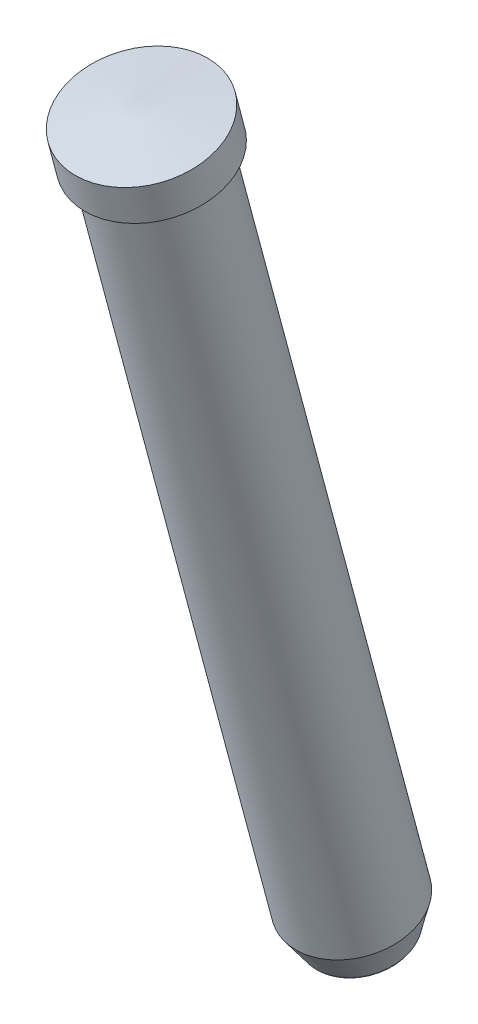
ISO-10303-21;
HEADER;
FILE_DESCRIPTION(('STEP AP214'),'2;1');
FILE_NAME('part.step','',(''),(''),'','','');
FILE_SCHEMA(('AUTOMOTIVE_DESIGN { 1 0 10303 214 1 1 1 1 }'));
ENDSEC;
DATA;
#1=APPLICATION_CONTEXT('core data for automotive mechanical design processes');
#2=APPLICATION_PROTOCOL_DEFINITION('international standard','automotive_design',2000,#1);
#3=PRODUCT_CONTEXT('',#1,'mechanical');
#4=PRODUCT('Part','Part','',(#3));
#5=PRODUCT_RELATED_PRODUCT_CATEGORY('part','',(#4));
#6=PRODUCT_DEFINITION_FORMATION('','',#4);
#7=PRODUCT_DEFINITION_CONTEXT('part definition',#1,'design');
#8=PRODUCT_DEFINITION('design','',#6,#7);
#9=PRODUCT_DEFINITION_SHAPE('','',#8);
#10=(LENGTH_UNIT() NAMED_UNIT(*) SI_UNIT(.MILLI.,.METRE.));
#11=(NAMED_UNIT(*) PLANE_ANGLE_UNIT() SI_UNIT($,.RADIAN.));
#12=(NAMED_UNIT(*) SI_UNIT($,.STERADIAN.) SOLID_ANGLE_UNIT());
#13=UNCERTAINTY_MEASURE_WITH_UNIT(LENGTH_MEASURE(1.E-05),#10,'distance_accuracy_value','');
#14=(GEOMETRIC_REPRESENTATION_CONTEXT(3) GLOBAL_UNCERTAINTY_ASSIGNED_CONTEXT((#13)) GLOBAL_UNIT_ASSIGNED_CONTEXT((#10,
#11,#12)) REPRESENTATION_CONTEXT('',''));
#15=CARTESIAN_POINT('',(0.,0.,0.));
#16=DIRECTION('',(0.,0.,1.));
#17=DIRECTION('',(1.,0.,0.));
#18=AXIS2_PLACEMENT_3D('',#15,#16,#17);
#19=CARTESIAN_POINT('',(-5.369024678,-51.300704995,-51.872205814));
#20=DIRECTION('',(0.,-0.96592582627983,-0.258819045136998));
#21=DIRECTION('',(0.,0.258819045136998,-0.96592582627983));
#22=AXIS2_PLACEMENT_3D('',#19,#20,#21);
#23=PLANE('',#22);
#24=CARTESIAN_POINT('',(0.,-51.284227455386,-51.9337008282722));
#25=CARTESIAN_POINT('',(10.6107207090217,-51.284227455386,-51.9337008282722));
#26=CARTESIAN_POINT('',(10.6107207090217,-48.5379708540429,-62.1828699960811));
#27=CARTESIAN_POINT('',(0.,-48.5379708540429,-62.1828699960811));
#28=(BOUNDED_CURVE() B_SPLINE_CURVE(3,(#24,#25,#26,#27),.UNSPECIFIED.,.F.,
.F.) B_SPLINE_CURVE_WITH_KNOTS((4,4),(0.,1.),
.UNSPECIFIED.) CURVE() GEOMETRIC_REPRESENTATION_ITEM() RATIONAL_B_SPLINE_CURVE((0.967213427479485,
0.322404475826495,0.322404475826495,0.967213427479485)) REPRESENTATION_ITEM(''));
#29=CARTESIAN_POINT('',(0.,-51.2842274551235,-51.9337008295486));
#30=VERTEX_POINT('',#29);
#31=CARTESIAN_POINT('',(0.,-48.5379708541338,-62.1828699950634));
#32=VERTEX_POINT('',#31);
#33=EDGE_CURVE('E66',#30,#32,#28,.T.);
#34=ORIENTED_EDGE('',*,*,#33,.F.);
#35=CARTESIAN_POINT('',(0.,-48.5379708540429,-62.1828699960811));
#36=CARTESIAN_POINT('',(-10.6107207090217,-48.5379708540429,-62.1828699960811));
#37=CARTESIAN_POINT('',(-10.6107207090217,-51.284227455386,-51.9337008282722));
#38=CARTESIAN_POINT('',(0.,-51.284227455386,-51.9337008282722));
#39=(BOUNDED_CURVE() B_SPLINE_CURVE(3,(#35,#36,#37,#38),.UNSPECIFIED.,.F.,
.F.) B_SPLINE_CURVE_WITH_KNOTS((4,4),(0.,1.),
.UNSPECIFIED.) CURVE() GEOMETRIC_REPRESENTATION_ITEM() RATIONAL_B_SPLINE_CURVE((0.967213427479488,
0.322404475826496,0.322404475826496,0.967213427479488)) REPRESENTATION_ITEM(''));
#40=EDGE_CURVE('E63',#32,#30,#39,.T.);
#41=ORIENTED_EDGE('',*,*,#40,.F.);
#42=EDGE_LOOP('',(#34,#41));
#43=FACE_BOUND('',#42,.T.);
#44=ADVANCED_FACE('F24',(#43),#23,.T.);
#45=CARTESIAN_POINT('',(0.,-50.837379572,-50.820154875));
#46=CARTESIAN_POINT('',(12.530620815,-50.837379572,-50.820154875));
#47=CARTESIAN_POINT('',(12.530620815,-47.594216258,-62.923805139));
#48=CARTESIAN_POINT('',(0.,-47.594216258,-62.923805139));
#49=CARTESIAN_POINT('',(0.,-51.267861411,-51.081587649));
#50=CARTESIAN_POINT('',(12.248405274,-51.267861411,-51.081587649));
#51=CARTESIAN_POINT('',(12.248405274,-48.097740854,-62.912638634));
#52=CARTESIAN_POINT('',(0.,-48.097740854,-62.912638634));
#53=CARTESIAN_POINT('',(0.,-51.43183329,-51.557796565));
#54=CARTESIAN_POINT('',(11.413318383,-51.43183329,-51.557796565));
#55=CARTESIAN_POINT('',(11.413318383,-48.477849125,-62.582215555));
#56=CARTESIAN_POINT('',(0.,-48.477849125,-62.582215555));
#57=CARTESIAN_POINT('',(0.,-51.25356306,-52.028839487));
#58=CARTESIAN_POINT('',(10.411053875,-51.25356306,-52.028839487));
#59=CARTESIAN_POINT('',(10.411053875,-48.558984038,-62.085145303));
#60=CARTESIAN_POINT('',(0.,-48.558984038,-62.085145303));
#61=(BOUNDED_SURFACE() B_SPLINE_SURFACE(3,3,((#45,#46,#47,#48),(#49,#50,#51,#52),(#53,#54,#55,
#56),(#57,#58,#59,#60)),.UNSPECIFIED.,.F.,.F.,.F.) B_SPLINE_SURFACE_WITH_KNOTS((4,4),(4,4),(0.,
1.),(0.,1.),.UNSPECIFIED.) GEOMETRIC_REPRESENTATION_ITEM() RATIONAL_B_SPLINE_SURFACE(((1.,
0.333333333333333,0.333333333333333,1.),(0.846046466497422,0.282015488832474,0.282015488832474,
0.846046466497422),(0.846046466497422,0.282015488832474,0.282015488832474,0.846046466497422),
(1.,0.333333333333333,0.333333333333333,1.))) REPRESENTATION_ITEM('') SURFACE());
#62=CARTESIAN_POINT('',(0.,-47.594216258,-62.923805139));
#63=CARTESIAN_POINT('',(0.,-48.097740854,-62.912638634));
#64=CARTESIAN_POINT('',(0.,-48.477849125,-62.582215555));
#65=CARTESIAN_POINT('',(0.,-48.558984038,-62.085145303));
#66=(BOUNDED_CURVE() B_SPLINE_CURVE(3,(#62,#63,#64,#65),.UNSPECIFIED.,.F.,
.F.) B_SPLINE_CURVE_WITH_KNOTS((4,4),(0.,1.),
.UNSPECIFIED.) CURVE() GEOMETRIC_REPRESENTATION_ITEM() RATIONAL_B_SPLINE_CURVE((1.,
0.846046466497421,0.846046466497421,1.)) REPRESENTATION_ITEM(''));
#67=CARTESIAN_POINT('',(2.79821379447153E-10,-47.6939143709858,-62.916597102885));
#68=VERTEX_POINT('',#67);
#69=EDGE_CURVE('E82',#68,#32,#66,.T.);
#70=CARTESIAN_POINT('',(0.,-49.3070155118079,-56.8964216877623));
#71=DIRECTION('',(0.,0.965925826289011,0.258819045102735));
#72=DIRECTION('',(0.,0.258819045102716,-0.965925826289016));
#73=AXIS2_PLACEMENT_3D('',#70,#71,#72);
#74=CIRCLE('',#73,6.23254420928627);
#75=CARTESIAN_POINT('',(1.91747427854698E-09,-50.9201166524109,-50.8762462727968));
#76=VERTEX_POINT('',#75);
#77=EDGE_CURVE('E78',#68,#76,#74,.F.);
#78=CARTESIAN_POINT('',(0.,-50.837379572,-50.820154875));
#79=CARTESIAN_POINT('',(0.,-51.267861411,-51.081587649));
#80=CARTESIAN_POINT('',(0.,-51.43183329,-51.557796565));
#81=CARTESIAN_POINT('',(0.,-51.25356306,-52.028839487));
#82=(BOUNDED_CURVE() B_SPLINE_CURVE(3,(#78,#79,#80,#81),.UNSPECIFIED.,.F.,
.F.) B_SPLINE_CURVE_WITH_KNOTS((4,4),(0.,1.),
.UNSPECIFIED.) CURVE() GEOMETRIC_REPRESENTATION_ITEM() RATIONAL_B_SPLINE_CURVE((1.,
0.846046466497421,0.846046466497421,1.)) REPRESENTATION_ITEM(''));
#83=EDGE_CURVE('E75',#30,#76,#82,.F.);
#84=ORIENTED_EDGE('',*,*,#69,.F.);
#85=ORIENTED_EDGE('',*,*,#77,.T.);
#86=ORIENTED_EDGE('',*,*,#83,.F.);
#87=ORIENTED_EDGE('',*,*,#33,.T.);
#88=EDGE_LOOP('',(#84,#85,#86,#87));
#89=FACE_BOUND('',#88,.T.);
#90=ADVANCED_FACE('F76',(#89),#61,.T.);
#91=CARTESIAN_POINT('',(0.,-47.594216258,-62.923805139));
#92=CARTESIAN_POINT('',(-12.530620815,-47.594216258,-62.923805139));
#93=CARTESIAN_POINT('',(-12.530620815,-50.837379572,-50.820154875));
#94=CARTESIAN_POINT('',(0.,-50.837379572,-50.820154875));
#95=CARTESIAN_POINT('',(0.,-48.097740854,-62.912638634));
#96=CARTESIAN_POINT('',(-12.248405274,-48.097740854,-62.912638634));
#97=CARTESIAN_POINT('',(-12.248405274,-51.267861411,-51.081587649));
#98=CARTESIAN_POINT('',(0.,-51.267861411,-51.081587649));
#99=CARTESIAN_POINT('',(0.,-48.477849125,-62.582215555));
#100=CARTESIAN_POINT('',(-11.413318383,-48.477849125,-62.582215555));
#101=CARTESIAN_POINT('',(-11.413318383,-51.43183329,-51.557796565));
#102=CARTESIAN_POINT('',(0.,-51.43183329,-51.557796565));
#103=CARTESIAN_POINT('',(0.,-48.558984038,-62.085145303));
#104=CARTESIAN_POINT('',(-10.411053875,-48.558984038,-62.085145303));
#105=CARTESIAN_POINT('',(-10.411053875,-51.25356306,-52.028839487));
#106=CARTESIAN_POINT('',(0.,-51.25356306,-52.028839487));
#107=(BOUNDED_SURFACE() B_SPLINE_SURFACE(3,3,((#91,#92,#93,#94),(#95,#96,#97,#98),(#99,#100,
#101,#102),(#103,#104,#105,#106)),.UNSPECIFIED.,.F.,.F.,.F.) B_SPLINE_SURFACE_WITH_KNOTS((4,4),
(4,4),(0.,1.),(0.,1.),
.UNSPECIFIED.) GEOMETRIC_REPRESENTATION_ITEM() RATIONAL_B_SPLINE_SURFACE(((1.,0.333333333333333,
0.333333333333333,1.),(0.846046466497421,0.282015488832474,0.282015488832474,0.846046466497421),
(0.846046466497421,0.282015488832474,0.282015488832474,0.846046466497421),(1.,0.333333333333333,
0.333333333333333,1.))) REPRESENTATION_ITEM('') SURFACE());
#108=CARTESIAN_POINT('',(0.,-49.3070155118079,-56.8964216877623));
#109=DIRECTION('',(0.,0.965925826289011,0.258819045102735));
#110=DIRECTION('',(0.,0.258819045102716,-0.965925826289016));
#111=AXIS2_PLACEMENT_3D('',#108,#109,#110);
#112=CIRCLE('',#111,6.23254420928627);
#113=EDGE_CURVE('E287',#76,#68,#112,.F.);
#114=ORIENTED_EDGE('',*,*,#113,.T.);
#115=ORIENTED_EDGE('',*,*,#69,.T.);
#116=ORIENTED_EDGE('',*,*,#40,.T.);
#117=ORIENTED_EDGE('',*,*,#83,.T.);
#118=EDGE_LOOP('',(#114,#115,#116,#117));
#119=FACE_BOUND('',#118,.T.);
#120=ADVANCED_FACE('F85',(#119),#107,.T.);
#121=CARTESIAN_POINT('',(0.,-49.3070155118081,-56.8964216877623));
#122=DIRECTION('',(0.,0.965925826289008,0.258819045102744));
#123=DIRECTION('',(0.,-0.258819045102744,0.965925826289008));
#124=AXIS2_PLACEMENT_3D('',#121,#122,#123);
#125=CONICAL_SURFACE('',#124,6.23254420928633,0.383972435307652);
#126=CARTESIAN_POINT('',(0.,-45.0814700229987,-55.7641901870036));
#127=DIRECTION('',(0.,-0.965925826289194,-0.258819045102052));
#128=DIRECTION('',(0.,-0.258819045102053,0.965925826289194));
#129=AXIS2_PLACEMENT_3D('',#126,#127,#128);
#130=CIRCLE('',#129,8.00000000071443);
#131=CARTESIAN_POINT('',(0.,-47.152022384,-48.036783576));
#132=VERTEX_POINT('',#131);
#133=EDGE_CURVE('E280',#132,#132,#130,.T.);
#134=ORIENTED_EDGE('',*,*,#133,.T.);
#135=EDGE_LOOP('',(#134));
#136=FACE_BOUND('',#135,.T.);
#137=ORIENTED_EDGE('',*,*,#113,.F.);
#138=ORIENTED_EDGE('',*,*,#77,.F.);
#139=EDGE_LOOP('',(#137,#138));
#140=FACE_BOUND('',#139,.T.);
#141=ADVANCED_FACE('F106',(#136,#140),#125,.T.);
#142=CARTESIAN_POINT('',(0.,57.3066675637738,-28.3293714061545));
#143=DIRECTION('',(0.,-0.965925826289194,-0.258819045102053));
#144=DIRECTION('',(0.,0.258819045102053,-0.965925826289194));
#145=AXIS2_PLACEMENT_3D('',#142,#143,#144);
#146=CYLINDRICAL_SURFACE('',#145,8.00000000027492);
#147=ORIENTED_EDGE('',*,*,#133,.F.);
#148=EDGE_LOOP('',(#147));
#149=FACE_BOUND('',#148,.T.);
#150=CARTESIAN_POINT('',(0.,57.3066675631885,-28.3293714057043));
#151=DIRECTION('',(0.,-0.965925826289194,-0.258819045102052));
#152=DIRECTION('',(0.,0.258819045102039,-0.965925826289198));
#153=AXIS2_PLACEMENT_3D('',#150,#151,#152);
#154=CIRCLE('',#153,7.99999999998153);
#155=CARTESIAN_POINT('',(0.,59.377219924,-36.056778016));
#156=VERTEX_POINT('',#155);
#157=EDGE_CURVE('E276',#156,#156,#154,.T.);
#158=ORIENTED_EDGE('',*,*,#157,.T.);
#159=EDGE_LOOP('',(#158));
#160=FACE_BOUND('',#159,.T.);
#161=ADVANCED_FACE('F233',(#149,#160),#146,.T.);
#162=CARTESIAN_POINT('',(0.,57.7848176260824,-28.2012514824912));
#163=DIRECTION('',(0.,-0.965925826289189,-0.258819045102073));
#164=DIRECTION('',(0.,0.258819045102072,-0.965925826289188));
#165=AXIS2_PLACEMENT_3D('',#162,#163,#164);
#166=CONICAL_SURFACE('',#165,7.80000000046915,0.383972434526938);
#167=CARTESIAN_POINT('',(0.,57.7848176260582,-28.2012514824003));
#168=DIRECTION('',(0.,0.965925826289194,0.258819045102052));
#169=DIRECTION('',(0.,0.258819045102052,-0.965925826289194));
#170=AXIS2_PLACEMENT_3D('',#167,#168,#169);
#171=CIRCLE('',#170,7.80000000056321);
#172=CARTESIAN_POINT('',(0.,59.803606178,-35.735472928));
#173=VERTEX_POINT('',#172);
#174=EDGE_CURVE('E274',#173,#173,#171,.F.);
#175=ORIENTED_EDGE('',*,*,#174,.T.);
#176=EDGE_LOOP('',(#175));
#177=FACE_BOUND('',#176,.T.);
#178=ORIENTED_EDGE('',*,*,#157,.F.);
#179=EDGE_LOOP('',(#178));
#180=FACE_BOUND('',#179,.T.);
#181=ADVANCED_FACE('F230',(#177,#180),#166,.T.);
#182=CARTESIAN_POINT('',(0.,57.7848176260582,-28.2012514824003));
#183=DIRECTION('',(0.,0.965925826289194,0.258819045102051));
#184=DIRECTION('',(0.,-0.258819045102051,0.965925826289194));
#185=AXIS2_PLACEMENT_3D('',#182,#183,#184);
#186=CYLINDRICAL_SURFACE('',#185,7.80000000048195);
#187=CARTESIAN_POINT('',(0.,58.0794082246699,-28.1223161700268));
#188=DIRECTION('',(0.,-0.965925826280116,-0.25881904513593));
#189=DIRECTION('',(0.,0.25881904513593,-0.965925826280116));
#190=AXIS2_PLACEMENT_3D('',#187,#188,#189);
#191=CIRCLE('',#190,7.79999999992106);
#192=CARTESIAN_POINT('',(7.99903371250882E-10,56.0606196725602,-20.5880947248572));
#193=VERTEX_POINT('',#192);
#194=CARTESIAN_POINT('',(0.,60.0981967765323,-35.6565376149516));
#195=VERTEX_POINT('',#194);
#196=EDGE_CURVE('E172',#193,#195,#191,.T.);
#197=ORIENTED_EDGE('',*,*,#196,.T.);
#198=CARTESIAN_POINT('',(0.,58.0794082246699,-28.1223161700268));
#199=DIRECTION('',(0.,-0.965925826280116,-0.25881904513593));
#200=DIRECTION('',(0.,0.25881904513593,-0.965925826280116));
#201=AXIS2_PLACEMENT_3D('',#198,#199,#200);
#202=CIRCLE('',#201,7.79999999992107);
#203=EDGE_CURVE('E192',#195,#193,#202,.T.);
#204=ORIENTED_EDGE('',*,*,#203,.T.);
#205=EDGE_LOOP('',(#197,#204));
#206=FACE_BOUND('',#205,.T.);
#207=ORIENTED_EDGE('',*,*,#174,.F.);
#208=EDGE_LOOP('',(#207));
#209=FACE_BOUND('',#208,.T.);
#210=ADVANCED_FACE('F218',(#206,#209),#186,.T.);
#211=CARTESIAN_POINT('',(0.,60.347348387,-35.81750391));
#212=CARTESIAN_POINT('',(16.039933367,60.347348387,-35.81750391));
#213=CARTESIAN_POINT('',(16.039933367,56.19590815,-20.324118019));
#214=CARTESIAN_POINT('',(0.,56.19590815,-20.324118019));
#215=CARTESIAN_POINT('',(0.,60.325333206,-35.682628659));
#216=CARTESIAN_POINT('',(15.767978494,60.325333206,-35.682628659));
#217=CARTESIAN_POINT('',(15.767978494,56.244280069,-20.451931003));
#218=CARTESIAN_POINT('',(0.,56.244280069,-20.451931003));
#219=CARTESIAN_POINT('',(0.,60.206982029,-35.614298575));
#220=CARTESIAN_POINT('',(15.574711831,60.206982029,-35.614298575));
#221=CARTESIAN_POINT('',(15.574711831,56.175949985,-20.57028218));
#222=CARTESIAN_POINT('',(0.,56.175949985,-20.57028218));
#223=CARTESIAN_POINT('',(0.,60.079169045,-35.662670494));
#224=CARTESIAN_POINT('',(15.601998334,60.079169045,-35.662670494));
#225=CARTESIAN_POINT('',(15.601998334,56.041074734,-20.592297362));
#226=CARTESIAN_POINT('',(0.,56.041074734,-20.592297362));
#227=(BOUNDED_SURFACE() B_SPLINE_SURFACE(3,3,((#211,#212,#213,#214),(#215,#216,#217,#218),(#219,
#220,#221,#222),(#223,#224,#225,#226)),.UNSPECIFIED.,.F.,.F.,
.F.) B_SPLINE_SURFACE_WITH_KNOTS((4,4),(4,4),(0.,1.),(0.,1.),
.UNSPECIFIED.) GEOMETRIC_REPRESENTATION_ITEM() RATIONAL_B_SPLINE_SURFACE(((1.,0.333333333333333,
0.333333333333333,1.),(0.755320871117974,0.251773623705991,0.251773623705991,0.755320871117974),
(0.755320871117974,0.251773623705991,0.251773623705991,0.755320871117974),(1.,0.333333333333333,
0.333333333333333,1.))) REPRESENTATION_ITEM('') SURFACE());
#228=CARTESIAN_POINT('',(0.,60.3431457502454,-35.7979589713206));
#229=CARTESIAN_POINT('',(16.0000000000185,60.3431457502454,-35.7979589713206));
#230=CARTESIAN_POINT('',(16.0000000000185,56.2020410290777,-20.3431457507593));
#231=CARTESIAN_POINT('',(0.,56.2020410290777,-20.3431457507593));
#232=(BOUNDED_CURVE() B_SPLINE_CURVE(3,(#228,#229,#230,#231),.UNSPECIFIED.,.F.,
.F.) B_SPLINE_CURVE_WITH_KNOTS((4,4),(0.,1.),
.UNSPECIFIED.) CURVE() GEOMETRIC_REPRESENTATION_ITEM() RATIONAL_B_SPLINE_CURVE((0.95657830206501,
0.31885943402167,0.31885943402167,0.95657830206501)) REPRESENTATION_ITEM(''));
#233=CARTESIAN_POINT('',(0.,56.2020410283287,-20.3431457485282));
#234=VERTEX_POINT('',#233);
#235=CARTESIAN_POINT('',(0.,60.3431457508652,-35.7979589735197));
#236=VERTEX_POINT('',#235);
#237=EDGE_CURVE('E147',#234,#236,#232,.F.);
#238=CARTESIAN_POINT('',(0.,56.19590815,-20.324118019));
#239=CARTESIAN_POINT('',(0.,56.244280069,-20.451931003));
#240=CARTESIAN_POINT('',(0.,56.175949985,-20.57028218));
#241=CARTESIAN_POINT('',(0.,56.041074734,-20.592297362));
#242=(BOUNDED_CURVE() B_SPLINE_CURVE(3,(#238,#239,#240,#241),.UNSPECIFIED.,.F.,
.F.) B_SPLINE_CURVE_WITH_KNOTS((4,4),(0.,1.),
.UNSPECIFIED.) CURVE() GEOMETRIC_REPRESENTATION_ITEM() RATIONAL_B_SPLINE_CURVE((1.,
0.755320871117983,0.755320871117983,1.)) REPRESENTATION_ITEM(''));
#243=EDGE_CURVE('E176',#234,#193,#242,.T.);
#244=CARTESIAN_POINT('',(0.,60.347348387,-35.81750391));
#245=CARTESIAN_POINT('',(0.,60.325333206,-35.682628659));
#246=CARTESIAN_POINT('',(0.,60.206982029,-35.614298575));
#247=CARTESIAN_POINT('',(0.,60.079169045,-35.662670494));
#248=(BOUNDED_CURVE() B_SPLINE_CURVE(3,(#244,#245,#246,#247),.UNSPECIFIED.,.F.,
.F.) B_SPLINE_CURVE_WITH_KNOTS((4,4),(0.,1.),
.UNSPECIFIED.) CURVE() GEOMETRIC_REPRESENTATION_ITEM() RATIONAL_B_SPLINE_CURVE((1.,
0.755320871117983,0.755320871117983,1.)) REPRESENTATION_ITEM(''));
#249=EDGE_CURVE('E171',#195,#236,#248,.F.);
#250=ORIENTED_EDGE('',*,*,#237,.F.);
#251=ORIENTED_EDGE('',*,*,#243,.T.);
#252=ORIENTED_EDGE('',*,*,#203,.F.);
#253=ORIENTED_EDGE('',*,*,#249,.T.);
#254=EDGE_LOOP('',(#250,#251,#252,#253));
#255=FACE_BOUND('',#254,.T.);
#256=ADVANCED_FACE('F206',(#255),#227,.F.);
#257=CARTESIAN_POINT('',(0.,56.19590815,-20.324118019));
#258=CARTESIAN_POINT('',(-16.039933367,56.19590815,-20.324118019));
#259=CARTESIAN_POINT('',(-16.039933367,60.347348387,-35.81750391));
#260=CARTESIAN_POINT('',(0.,60.347348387,-35.81750391));
#261=CARTESIAN_POINT('',(0.,56.244280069,-20.451931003));
#262=CARTESIAN_POINT('',(-15.767978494,56.244280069,-20.451931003));
#263=CARTESIAN_POINT('',(-15.767978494,60.325333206,-35.682628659));
#264=CARTESIAN_POINT('',(0.,60.325333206,-35.682628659));
#265=CARTESIAN_POINT('',(0.,56.175949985,-20.57028218));
#266=CARTESIAN_POINT('',(-15.574711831,56.175949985,-20.57028218));
#267=CARTESIAN_POINT('',(-15.574711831,60.206982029,-35.614298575));
#268=CARTESIAN_POINT('',(0.,60.206982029,-35.614298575));
#269=CARTESIAN_POINT('',(0.,56.041074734,-20.592297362));
#270=CARTESIAN_POINT('',(-15.601998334,56.041074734,-20.592297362));
#271=CARTESIAN_POINT('',(-15.601998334,60.079169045,-35.662670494));
#272=CARTESIAN_POINT('',(0.,60.079169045,-35.662670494));
#273=(BOUNDED_SURFACE() B_SPLINE_SURFACE(3,3,((#257,#258,#259,#260),(#261,#262,#263,#264),(#265,
#266,#267,#268),(#269,#270,#271,#272)),.UNSPECIFIED.,.F.,.F.,
.F.) B_SPLINE_SURFACE_WITH_KNOTS((4,4),(4,4),(0.,1.),(0.,1.),
.UNSPECIFIED.) GEOMETRIC_REPRESENTATION_ITEM() RATIONAL_B_SPLINE_SURFACE(((1.,0.333333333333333,
0.333333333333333,1.),(0.755320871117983,0.251773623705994,0.251773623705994,0.755320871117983),
(0.755320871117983,0.251773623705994,0.251773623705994,0.755320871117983),(1.,0.333333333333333,
0.333333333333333,1.))) REPRESENTATION_ITEM('') SURFACE());
#274=CARTESIAN_POINT('',(0.,56.2020410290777,-20.3431457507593));
#275=CARTESIAN_POINT('',(-16.0000000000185,56.2020410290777,-20.3431457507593));
#276=CARTESIAN_POINT('',(-16.0000000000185,60.3431457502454,-35.7979589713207));
#277=CARTESIAN_POINT('',(0.,60.3431457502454,-35.7979589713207));
#278=(BOUNDED_CURVE() B_SPLINE_CURVE(3,(#274,#275,#276,#277),.UNSPECIFIED.,.F.,
.F.) B_SPLINE_CURVE_WITH_KNOTS((4,4),(0.,1.),
.UNSPECIFIED.) CURVE() GEOMETRIC_REPRESENTATION_ITEM() RATIONAL_B_SPLINE_CURVE((0.956578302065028,
0.318859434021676,0.318859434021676,0.956578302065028)) REPRESENTATION_ITEM(''));
#279=EDGE_CURVE('E157',#236,#234,#278,.F.);
#280=ORIENTED_EDGE('',*,*,#196,.F.);
#281=ORIENTED_EDGE('',*,*,#243,.F.);
#282=ORIENTED_EDGE('',*,*,#279,.F.);
#283=ORIENTED_EDGE('',*,*,#249,.F.);
#284=EDGE_LOOP('',(#280,#281,#282,#283));
#285=FACE_BOUND('',#284,.T.);
#286=ADVANCED_FACE('F217',(#285),#273,.F.);
#287=CARTESIAN_POINT('',(9.3104,60.682302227,-37.063708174));
#288=DIRECTION('',(0.,-0.965925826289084,-0.258819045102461));
#289=DIRECTION('',(0.,-0.258819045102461,0.965925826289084));
#290=AXIS2_PLACEMENT_3D('',#287,#288,#289);
#291=PLANE('',#290);
#292=ORIENTED_EDGE('',*,*,#237,.T.);
#293=ORIENTED_EDGE('',*,*,#279,.T.);
#294=EDGE_LOOP('',(#292,#293));
#295=FACE_BOUND('',#294,.T.);
#296=CARTESIAN_POINT('',(0.,58.2725933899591,-28.0705523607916));
#297=DIRECTION('',(0.,0.965925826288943,0.25881904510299));
#298=DIRECTION('',(0.,-0.25881904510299,0.965925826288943));
#299=AXIS2_PLACEMENT_3D('',#296,#297,#298);
#300=CIRCLE('',#299,9.20000000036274);
#301=CARTESIAN_POINT('',(0.,55.8914581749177,-19.184034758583));
#302=VERTEX_POINT('',#301);
#303=EDGE_CURVE('E29',#302,#302,#300,.F.);
#304=ORIENTED_EDGE('',*,*,#303,.T.);
#305=EDGE_LOOP('',(#304));
#306=FACE_BOUND('',#305,.T.);
#307=ADVANCED_FACE('F26',(#295,#306),#291,.T.);
#308=CARTESIAN_POINT('',(0.,58.2725933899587,-28.0705523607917));
#309=DIRECTION('',(0.,0.965925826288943,0.25881904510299));
#310=DIRECTION('',(0.,-0.25881904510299,0.965925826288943));
#311=AXIS2_PLACEMENT_3D('',#308,#309,#310);
#312=CONICAL_SURFACE('',#311,9.20000000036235,0.785398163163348);
#313=CARTESIAN_POINT('',(0.,58.5623711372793,-27.9929066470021));
#314=DIRECTION('',(0.,-0.965925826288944,-0.258819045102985));
#315=DIRECTION('',(0.,-0.258819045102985,0.965925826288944));
#316=AXIS2_PLACEMENT_3D('',#313,#314,#315);
#317=CIRCLE('',#316,9.49999999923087);
#318=CARTESIAN_POINT('',(0.,56.103590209,-18.816611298));
#319=VERTEX_POINT('',#318);
#320=EDGE_CURVE('E35',#319,#319,#317,.T.);
#321=ORIENTED_EDGE('',*,*,#320,.T.);
#322=EDGE_LOOP('',(#321));
#323=FACE_BOUND('',#322,.T.);
#324=ORIENTED_EDGE('',*,*,#303,.F.);
#325=EDGE_LOOP('',(#324));
#326=FACE_BOUND('',#325,.T.);
#327=ADVANCED_FACE('F251',(#323,#326),#312,.T.);
#328=CARTESIAN_POINT('',(0.,63.5412190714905,-26.6588283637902));
#329=DIRECTION('',(0.,-0.965925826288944,-0.258819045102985));
#330=DIRECTION('',(0.,0.258819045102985,-0.965925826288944));
#331=AXIS2_PLACEMENT_3D('',#328,#329,#330);
#332=CYLINDRICAL_SURFACE('',#331,9.49999999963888);
#333=ORIENTED_EDGE('',*,*,#320,.F.);
#334=EDGE_LOOP('',(#333));
#335=FACE_BOUND('',#334,.T.);
#336=CARTESIAN_POINT('',(0.,63.5412190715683,-26.6588283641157));
#337=DIRECTION('',(0.,-0.965925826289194,-0.258819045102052));
#338=DIRECTION('',(0.,-0.258819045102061,0.965925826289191));
#339=AXIS2_PLACEMENT_3D('',#336,#337,#338);
#340=CIRCLE('',#339,9.50000000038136);
#341=CARTESIAN_POINT('',(0.,61.082438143,-17.482533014));
#342=VERTEX_POINT('',#341);
#343=EDGE_CURVE('E13',#342,#342,#340,.T.);
#344=ORIENTED_EDGE('',*,*,#343,.T.);
#345=EDGE_LOOP('',(#344));
#346=FACE_BOUND('',#345,.T.);
#347=ADVANCED_FACE('F246',(#335,#346),#332,.T.);
#348=CARTESIAN_POINT('',(0.,66.,-26.));
#349=DIRECTION('',(0.,-0.965925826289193,-0.258819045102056));
#350=DIRECTION('',(0.,0.258819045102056,-0.965925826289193));
#351=AXIS2_PLACEMENT_3D('',#348,#349,#350);
#352=CONICAL_SURFACE('',#351,0.,1.30899693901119);
#353=CARTESIAN_POINT('',(0.,65.9999999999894,-25.9999999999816));
#354=VERTEX_POINT('',#353);
#355=VERTEX_LOOP('',#354);
#356=FACE_BOUND('',#355,.T.);
#357=ORIENTED_EDGE('',*,*,#343,.F.);
#358=EDGE_LOOP('',(#357));
#359=FACE_BOUND('',#358,.T.);
#360=ADVANCED_FACE('F244',(#356,#359),#352,.T.);
#361=CLOSED_SHELL('',(#44,#90,#120,#141,#161,#181,#210,#256,#286,#307,#327,#347,#360));
#362=MANIFOLD_SOLID_BREP('B1',#361);
#363=ADVANCED_BREP_SHAPE_REPRESENTATION('',(#18,#362),#14);
#364=SHAPE_DEFINITION_REPRESENTATION(#9,#363);
ENDSEC;
END-ISO-10303-21;
